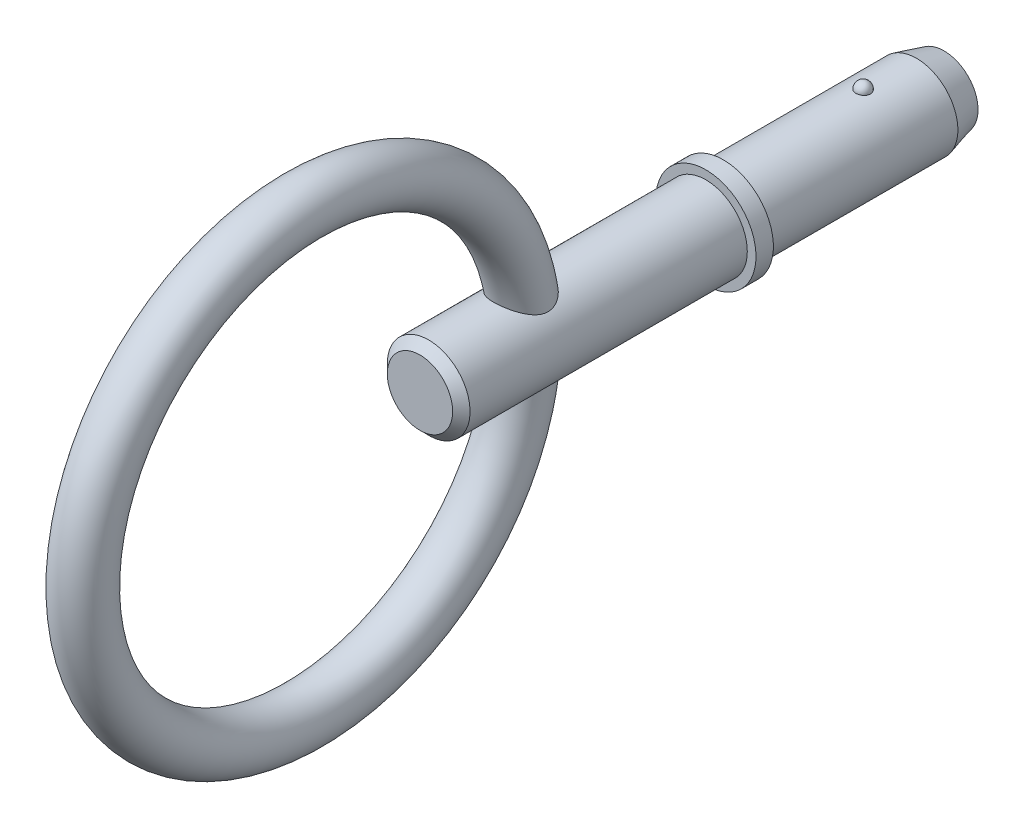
ISO-10303-21;
HEADER;
FILE_DESCRIPTION(('STEP AP214'),'2;1');
FILE_NAME('part.step','',(''),(''),'','','');
FILE_SCHEMA(('AUTOMOTIVE_DESIGN { 1 0 10303 214 1 1 1 1 }'));
ENDSEC;
DATA;
#1=APPLICATION_CONTEXT('core data for automotive mechanical design processes');
#2=APPLICATION_PROTOCOL_DEFINITION('international standard','automotive_design',2000,#1);
#3=PRODUCT_CONTEXT('',#1,'mechanical');
#4=PRODUCT('Part','Part','',(#3));
#5=PRODUCT_RELATED_PRODUCT_CATEGORY('part','',(#4));
#6=PRODUCT_DEFINITION_FORMATION('','',#4);
#7=PRODUCT_DEFINITION_CONTEXT('part definition',#1,'design');
#8=PRODUCT_DEFINITION('design','',#6,#7);
#9=PRODUCT_DEFINITION_SHAPE('','',#8);
#10=(LENGTH_UNIT() NAMED_UNIT(*) SI_UNIT(.MILLI.,.METRE.));
#11=(NAMED_UNIT(*) PLANE_ANGLE_UNIT() SI_UNIT($,.RADIAN.));
#12=(NAMED_UNIT(*) SI_UNIT($,.STERADIAN.) SOLID_ANGLE_UNIT());
#13=UNCERTAINTY_MEASURE_WITH_UNIT(LENGTH_MEASURE(1.E-05),#10,'distance_accuracy_value','');
#14=(GEOMETRIC_REPRESENTATION_CONTEXT(3) GLOBAL_UNCERTAINTY_ASSIGNED_CONTEXT((#13)) GLOBAL_UNIT_ASSIGNED_CONTEXT((#10,
#11,#12)) REPRESENTATION_CONTEXT('',''));
#15=CARTESIAN_POINT('',(0.,0.,0.));
#16=DIRECTION('',(0.,0.,1.));
#17=DIRECTION('',(1.,0.,0.));
#18=AXIS2_PLACEMENT_3D('',#15,#16,#17);
#19=CARTESIAN_POINT('',(0.,0.,7.62));
#20=DIRECTION('',(0.,0.,-1.));
#21=DIRECTION('',(-1.,0.,0.));
#22=AXIS2_PLACEMENT_3D('',#19,#20,#21);
#23=CYLINDRICAL_SURFACE('',#22,2.38);
#24=CARTESIAN_POINT('',(0.418361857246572,2.34294117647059,-0.419999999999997));
#25=CARTESIAN_POINT('',(0.418361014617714,2.34294160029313,-0.396453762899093));
#26=CARTESIAN_POINT('',(0.416399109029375,2.34329426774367,-0.372895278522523));
#27=CARTESIAN_POINT('',(0.408599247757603,2.34466666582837,-0.32643458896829));
#28=CARTESIAN_POINT('',(0.402757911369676,2.34568697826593,-0.303532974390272));
#29=CARTESIAN_POINT('',(0.387358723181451,2.3482789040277,-0.259059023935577));
#30=CARTESIAN_POINT('',(0.377802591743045,2.34985026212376,-0.237486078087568));
#31=CARTESIAN_POINT('',(0.355233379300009,2.35336760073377,-0.196270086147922));
#32=CARTESIAN_POINT('',(0.34222083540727,2.3553135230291,-0.176626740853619));
#33=CARTESIAN_POINT('',(0.313060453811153,2.35936636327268,-0.139777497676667));
#34=CARTESIAN_POINT('',(0.296906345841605,2.36147359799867,-0.122576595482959));
#35=CARTESIAN_POINT('',(0.261921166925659,2.3656092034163,-0.0911421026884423));
#36=CARTESIAN_POINT('',(0.243090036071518,2.36763757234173,-0.0769085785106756));
#37=CARTESIAN_POINT('',(0.203297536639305,2.37138533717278,-0.0518262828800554));
#38=CARTESIAN_POINT('',(0.182338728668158,2.37310509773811,-0.0409735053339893));
#39=CARTESIAN_POINT('',(0.138864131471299,2.37604521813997,-0.0229395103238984));
#40=CARTESIAN_POINT('',(0.116348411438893,2.37726560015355,-0.0157581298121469));
#41=CARTESIAN_POINT('',(0.0705754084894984,2.37906276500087,-0.00531205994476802));
#42=CARTESIAN_POINT('',(0.0473247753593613,2.37964420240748,-0.00201903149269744));
#43=CARTESIAN_POINT('',(0.000593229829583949,2.38011460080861,0.000651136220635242));
#44=CARTESIAN_POINT('',(-0.0228876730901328,2.38000359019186,2.84360175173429E-05));
#45=CARTESIAN_POINT('',(-0.0692686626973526,2.37910422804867,-0.00509943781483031));
#46=CARTESIAN_POINT('',(-0.0921713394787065,2.37831983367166,-0.00958192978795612));
#47=CARTESIAN_POINT('',(-0.136890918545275,2.37616546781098,-0.022272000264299));
#48=CARTESIAN_POINT('',(-0.158707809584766,2.37479549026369,-0.0304796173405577));
#49=CARTESIAN_POINT('',(-0.200704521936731,2.37161607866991,-0.0504168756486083));
#50=CARTESIAN_POINT('',(-0.220879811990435,2.36980547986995,-0.0621558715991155));
#51=CARTESIAN_POINT('',(-0.258974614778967,2.36594575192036,-0.0888218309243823));
#52=CARTESIAN_POINT('',(-0.276894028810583,2.36389661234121,-0.103748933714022));
#53=CARTESIAN_POINT('',(-0.310124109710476,2.35976825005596,-0.136509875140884));
#54=CARTESIAN_POINT('',(-0.325413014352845,2.35768891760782,-0.154365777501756));
#55=CARTESIAN_POINT('',(-0.352793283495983,2.35374782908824,-0.192402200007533));
#56=CARTESIAN_POINT('',(-0.364884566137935,2.35188607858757,-0.212582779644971));
#57=CARTESIAN_POINT('',(-0.385587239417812,2.34858114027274,-0.254794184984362));
#58=CARTESIAN_POINT('',(-0.394183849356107,2.34713973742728,-0.276832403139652));
#59=CARTESIAN_POINT('',(-0.407590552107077,2.3448489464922,-0.322061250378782));
#60=CARTESIAN_POINT('',(-0.412400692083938,2.34399955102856,-0.34525186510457));
#61=CARTESIAN_POINT('',(-0.418098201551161,2.34299005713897,-0.392078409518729));
#62=CARTESIAN_POINT('',(-0.41899328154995,2.34282860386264,-0.415713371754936));
#63=CARTESIAN_POINT('',(-0.416857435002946,2.34320955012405,-0.462799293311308));
#64=CARTESIAN_POINT('',(-0.413826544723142,2.34375194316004,-0.486250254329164));
#65=CARTESIAN_POINT('',(-0.403929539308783,2.34547773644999,-0.532261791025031));
#66=CARTESIAN_POINT('',(-0.397069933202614,2.34666004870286,-0.554823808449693));
#67=CARTESIAN_POINT('',(-0.379705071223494,2.34953208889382,-0.59846383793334));
#68=CARTESIAN_POINT('',(-0.369199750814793,2.35122182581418,-0.61954182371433));
#69=CARTESIAN_POINT('',(-0.344797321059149,2.35492396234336,-0.659671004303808));
#70=CARTESIAN_POINT('',(-0.33089223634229,2.35693711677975,-0.678717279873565));
#71=CARTESIAN_POINT('',(-0.300080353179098,2.36105754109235,-0.714192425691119));
#72=CARTESIAN_POINT('',(-0.283173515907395,2.36316481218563,-0.730621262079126));
#73=CARTESIAN_POINT('',(-0.246801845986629,2.36723962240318,-0.760416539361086));
#74=CARTESIAN_POINT('',(-0.227334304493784,2.36920701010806,-0.773779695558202));
#75=CARTESIAN_POINT('',(-0.186398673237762,2.37277833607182,-0.797042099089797));
#76=CARTESIAN_POINT('',(-0.164930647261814,2.37438228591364,-0.806941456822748));
#77=CARTESIAN_POINT('',(-0.120727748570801,2.37703848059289,-0.82294821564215));
#78=CARTESIAN_POINT('',(-0.0980005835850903,2.37809374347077,-0.829076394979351));
#79=CARTESIAN_POINT('',(-0.0518218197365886,2.37954782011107,-0.837451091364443));
#80=CARTESIAN_POINT('',(-0.0283702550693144,2.37994666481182,-0.839697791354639));
#81=CARTESIAN_POINT('',(0.0184023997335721,2.38004290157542,-0.840243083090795));
#82=CARTESIAN_POINT('',(0.0417231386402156,2.37974556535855,-0.838571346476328));
#83=CARTESIAN_POINT('',(0.0877471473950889,2.37849333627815,-0.831389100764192));
#84=CARTESIAN_POINT('',(0.110450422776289,2.37753844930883,-0.825878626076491));
#85=CARTESIAN_POINT('',(0.154584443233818,2.37507730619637,-0.811179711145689));
#86=CARTESIAN_POINT('',(0.17601599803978,2.37357140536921,-0.801993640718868));
#87=CARTESIAN_POINT('',(0.217028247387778,2.37017355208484,-0.780200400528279));
#88=CARTESIAN_POINT('',(0.236608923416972,2.36828159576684,-0.767593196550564));
#89=CARTESIAN_POINT('',(0.27351405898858,2.36430486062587,-0.739207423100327));
#90=CARTESIAN_POINT('',(0.290821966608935,2.36221883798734,-0.723407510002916));
#91=CARTESIAN_POINT('',(0.322554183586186,2.3580957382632,-0.68912612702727));
#92=CARTESIAN_POINT('',(0.336977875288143,2.35605867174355,-0.670644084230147));
#93=CARTESIAN_POINT('',(0.362636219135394,2.35224677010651,-0.63138169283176));
#94=CARTESIAN_POINT('',(0.373848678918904,2.35047379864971,-0.610586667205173));
#95=CARTESIAN_POINT('',(0.392641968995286,2.34740786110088,-0.567397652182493));
#96=CARTESIAN_POINT('',(0.400225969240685,2.34611447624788,-0.545005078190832));
#97=CARTESIAN_POINT('',(0.410033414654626,2.34441668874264,-0.505456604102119));
#98=CARTESIAN_POINT('',(0.413152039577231,2.34386644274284,-0.488523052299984));
#99=CARTESIAN_POINT('',(0.417316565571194,2.34312853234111,-0.454395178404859));
#100=CARTESIAN_POINT('',(0.418362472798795,2.34294086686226,-0.437200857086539));
#101=CARTESIAN_POINT('',(0.418361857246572,2.34294117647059,-0.419999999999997));
#102=B_SPLINE_CURVE_WITH_KNOTS('',3,(#24,#25,#26,#27,#28,#29,#30,#31,#32,#33,#34,#35,#36,#37,
#38,#39,#40,#41,#42,#43,#44,#45,#46,#47,#48,#49,#50,#51,#52,#53,#54,#55,#56,#57,#58,#59,#60,#61,
#62,#63,#64,#65,#66,#67,#68,#69,#70,#71,#72,#73,#74,#75,#76,#77,#78,#79,#80,#81,#82,#83,#84,#85,
#86,#87,#88,#89,#90,#91,#92,#93,#94,#95,#96,#97,#98,#99,#100,#101),.UNSPECIFIED.,.T.,.F.,(4,2,2,
2,2,2,2,2,2,2,2,2,2,2,2,2,2,2,2,2,2,2,2,2,2,2,2,2,2,2,2,2,2,2,2,2,2,2,4),(0.,0.0705763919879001,
0.141214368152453,0.211819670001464,0.282414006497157,0.353150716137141,0.423889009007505,
0.494543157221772,0.565194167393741,0.635327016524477,0.705456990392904,0.77517764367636,
0.844899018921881,0.914806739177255,0.98471751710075,1.05518143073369,1.1256471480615,
1.19640787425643,1.26716771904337,1.33778814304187,1.40840791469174,1.47890799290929,
1.54940931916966,1.62007764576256,1.69074688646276,1.76149149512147,1.83223384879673,
1.90258285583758,1.97292854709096,2.04274328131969,2.11255738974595,2.18232655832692,
2.25209642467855,2.32234913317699,2.39261687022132,2.4633591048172,2.5340394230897,
2.58559662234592,2.63715366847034),.UNSPECIFIED.);
#103=CARTESIAN_POINT('',(0.418361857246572,2.34294117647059,-0.419999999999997));
#104=VERTEX_POINT('',#103);
#105=EDGE_CURVE('E103',#104,#104,#102,.T.);
#106=ORIENTED_EDGE('',*,*,#105,.T.);
#107=EDGE_LOOP('',(#106));
#108=FACE_BOUND('',#107,.T.);
#109=CARTESIAN_POINT('',(0.,0.,-3.49399999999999));
#110=DIRECTION('',(0.,0.,-1.));
#111=DIRECTION('',(-1.,0.,0.));
#112=AXIS2_PLACEMENT_3D('',#109,#110,#111);
#113=CIRCLE('',#112,2.38);
#114=CARTESIAN_POINT('',(-2.38,0.,-3.49399999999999));
#115=VERTEX_POINT('',#114);
#116=EDGE_CURVE('E111',#115,#115,#113,.F.);
#117=ORIENTED_EDGE('',*,*,#116,.T.);
#118=EDGE_LOOP('',(#117));
#119=FACE_BOUND('',#118,.T.);
#120=CARTESIAN_POINT('',(0.,0.,7.62));
#121=DIRECTION('',(0.,0.,1.));
#122=DIRECTION('',(1.,0.,0.));
#123=AXIS2_PLACEMENT_3D('',#120,#121,#122);
#124=CIRCLE('',#123,2.38);
#125=CARTESIAN_POINT('',(2.38,0.,7.62));
#126=VERTEX_POINT('',#125);
#127=EDGE_CURVE('E109',#126,#126,#124,.T.);
#128=ORIENTED_EDGE('',*,*,#127,.F.);
#129=EDGE_LOOP('',(#128));
#130=FACE_BOUND('',#129,.T.);
#131=ADVANCED_FACE('F39',(#108,#119,#130),#23,.T.);
#132=CARTESIAN_POINT('',(0.,0.,-5.08));
#133=DIRECTION('',(0.,0.,-1.));
#134=DIRECTION('',(-1.,0.,0.));
#135=AXIS2_PLACEMENT_3D('',#132,#133,#134);
#136=PLANE('',#135);
#137=CARTESIAN_POINT('',(0.,0.,-5.08));
#138=DIRECTION('',(0.,0.,-1.));
#139=DIRECTION('',(-1.,0.,0.));
#140=AXIS2_PLACEMENT_3D('',#137,#138,#139);
#141=CIRCLE('',#140,1.95503258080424);
#142=CARTESIAN_POINT('',(-1.95503258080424,0.,-5.08));
#143=VERTEX_POINT('',#142);
#144=EDGE_CURVE('E142',#143,#143,#141,.T.);
#145=ORIENTED_EDGE('',*,*,#144,.T.);
#146=EDGE_LOOP('',(#145));
#147=FACE_BOUND('',#146,.T.);
#148=ADVANCED_FACE('F89',(#147),#136,.T.);
#149=CARTESIAN_POINT('',(0.,0.,-5.08));
#150=DIRECTION('',(0.,0.,1.));
#151=DIRECTION('',(1.,0.,0.));
#152=AXIS2_PLACEMENT_3D('',#149,#150,#151);
#153=CONICAL_SURFACE('',#152,1.95503258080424,0.261799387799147);
#154=ORIENTED_EDGE('',*,*,#116,.F.);
#155=EDGE_LOOP('',(#154));
#156=FACE_BOUND('',#155,.T.);
#157=ORIENTED_EDGE('',*,*,#144,.F.);
#158=EDGE_LOOP('',(#157));
#159=FACE_BOUND('',#158,.T.);
#160=ADVANCED_FACE('F95',(#156,#159),#153,.T.);
#161=CARTESIAN_POINT('',(0.,2.38,-0.419999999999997));
#162=DIRECTION('',(0.,1.,0.));
#163=DIRECTION('',(0.,0.,1.));
#164=AXIS2_PLACEMENT_3D('',#161,#162,#163);
#165=SPHERICAL_SURFACE('',#164,0.419999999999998);
#166=ORIENTED_EDGE('',*,*,#105,.F.);
#167=EDGE_LOOP('',(#166));
#168=FACE_BOUND('',#167,.T.);
#169=ADVANCED_FACE('F114',(#168),#165,.T.);
#170=CARTESIAN_POINT('',(0.,0.,7.62));
#171=DIRECTION('',(0.,0.,-1.));
#172=DIRECTION('',(-1.,0.,0.));
#173=AXIS2_PLACEMENT_3D('',#170,#171,#172);
#174=PLANE('',#173);
#175=ORIENTED_EDGE('',*,*,#127,.T.);
#176=EDGE_LOOP('',(#175));
#177=FACE_BOUND('',#176,.T.);
#178=CARTESIAN_POINT('',(0.,0.,7.62));
#179=DIRECTION('',(0.,0.,-1.));
#180=DIRECTION('',(-1.,0.,0.));
#181=AXIS2_PLACEMENT_3D('',#178,#179,#180);
#182=CIRCLE('',#181,2.88);
#183=CARTESIAN_POINT('',(-2.88,0.,7.62));
#184=VERTEX_POINT('',#183);
#185=EDGE_CURVE('E110',#184,#184,#182,.T.);
#186=ORIENTED_EDGE('',*,*,#185,.T.);
#187=EDGE_LOOP('',(#186));
#188=FACE_BOUND('',#187,.T.);
#189=ADVANCED_FACE('F118',(#177,#188),#174,.T.);
#190=CARTESIAN_POINT('',(0.,0.,33.7287874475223));
#191=DIRECTION('',(0.,0.,-1.));
#192=DIRECTION('',(-1.,0.,0.));
#193=AXIS2_PLACEMENT_3D('',#190,#191,#192);
#194=CYLINDRICAL_SURFACE('',#193,2.88);
#195=CARTESIAN_POINT('',(0.,0.,8.62));
#196=DIRECTION('',(0.,0.,-1.));
#197=DIRECTION('',(-1.,0.,0.));
#198=AXIS2_PLACEMENT_3D('',#195,#196,#197);
#199=CIRCLE('',#198,2.88);
#200=CARTESIAN_POINT('',(-2.88,0.,8.62));
#201=VERTEX_POINT('',#200);
#202=EDGE_CURVE('E135',#201,#201,#199,.T.);
#203=ORIENTED_EDGE('',*,*,#202,.T.);
#204=EDGE_LOOP('',(#203));
#205=FACE_BOUND('',#204,.T.);
#206=ORIENTED_EDGE('',*,*,#185,.F.);
#207=EDGE_LOOP('',(#206));
#208=FACE_BOUND('',#207,.T.);
#209=ADVANCED_FACE('F122',(#205,#208),#194,.T.);
#210=CARTESIAN_POINT('',(0.,2.88,8.62));
#211=DIRECTION('',(0.,0.,1.));
#212=DIRECTION('',(1.,0.,0.));
#213=AXIS2_PLACEMENT_3D('',#210,#211,#212);
#214=PLANE('',#213);
#215=CARTESIAN_POINT('',(0.,0.,8.62));
#216=DIRECTION('',(0.,0.,1.));
#217=DIRECTION('',(1.,0.,0.));
#218=AXIS2_PLACEMENT_3D('',#215,#216,#217);
#219=CIRCLE('',#218,2.38);
#220=CARTESIAN_POINT('',(2.38,0.,8.62));
#221=VERTEX_POINT('',#220);
#222=EDGE_CURVE('E113',#221,#221,#219,.T.);
#223=ORIENTED_EDGE('',*,*,#222,.F.);
#224=EDGE_LOOP('',(#223));
#225=FACE_BOUND('',#224,.T.);
#226=ORIENTED_EDGE('',*,*,#202,.F.);
#227=EDGE_LOOP('',(#226));
#228=FACE_BOUND('',#227,.T.);
#229=ADVANCED_FACE('F86',(#225,#228),#214,.T.);
#230=CARTESIAN_POINT('',(0.,0.,25.07));
#231=DIRECTION('',(0.,0.,-1.));
#232=DIRECTION('',(-1.,0.,0.));
#233=AXIS2_PLACEMENT_3D('',#230,#231,#232);
#234=CYLINDRICAL_SURFACE('',#233,2.38);
#235=CARTESIAN_POINT('',(-0.903407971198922,-2.20187511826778,18.048101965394));
#236=CARTESIAN_POINT('',(-0.839710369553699,-2.22800560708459,18.0036275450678));
#237=CARTESIAN_POINT('',(-0.771955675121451,-2.25255828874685,17.9639200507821));
#238=CARTESIAN_POINT('',(-0.629623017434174,-2.29641711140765,17.8949006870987));
#239=CARTESIAN_POINT('',(-0.55503412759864,-2.31571464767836,17.8656058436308));
#240=CARTESIAN_POINT('',(-0.40067374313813,-2.34735542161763,17.8182943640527));
#241=CARTESIAN_POINT('',(-0.320887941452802,-2.35967847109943,17.8003104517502));
#242=CARTESIAN_POINT('',(-0.158738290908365,-2.37609587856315,17.7764617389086));
#243=CARTESIAN_POINT('',(-0.0763765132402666,-2.38019668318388,17.7705874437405));
#244=CARTESIAN_POINT('',(0.0836658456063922,-2.3797998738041,17.7711603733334));
#245=CARTESIAN_POINT('',(0.161351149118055,-2.37576936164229,17.7769382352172));
#246=CARTESIAN_POINT('',(0.314409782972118,-2.36039486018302,17.7992676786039));
#247=CARTESIAN_POINT('',(0.389782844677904,-2.34905002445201,17.8158205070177));
#248=CARTESIAN_POINT('',(0.535937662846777,-2.32006569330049,17.8590515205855));
#249=CARTESIAN_POINT('',(0.606735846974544,-2.30245039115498,17.8856908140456));
#250=CARTESIAN_POINT('',(0.742521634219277,-2.26231731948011,17.9483720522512));
#251=CARTESIAN_POINT('',(0.8075080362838,-2.23979853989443,17.9844159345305));
#252=CARTESIAN_POINT('',(0.935326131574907,-2.18966592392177,18.0683563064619));
#253=CARTESIAN_POINT('',(0.997591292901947,-2.16179128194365,18.1169595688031));
#254=CARTESIAN_POINT('',(1.11292144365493,-2.10474548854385,18.223560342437));
#255=CARTESIAN_POINT('',(1.16597568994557,-2.07557287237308,18.2815686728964));
#256=CARTESIAN_POINT('',(1.26477130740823,-2.01699124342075,18.4102977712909));
#257=CARTESIAN_POINT('',(1.30983402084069,-1.98768494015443,18.4815920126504));
#258=CARTESIAN_POINT('',(1.38660631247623,-1.93491744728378,18.6329637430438));
#259=CARTESIAN_POINT('',(1.41834090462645,-1.91144534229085,18.7130244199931));
#260=CARTESIAN_POINT('',(1.46422131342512,-1.87648847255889,18.8706940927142));
#261=CARTESIAN_POINT('',(1.47990731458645,-1.86397592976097,18.9476190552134));
#262=CARTESIAN_POINT('',(1.49871691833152,-1.84889326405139,19.1038974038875));
#263=CARTESIAN_POINT('',(1.50185388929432,-1.84631256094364,19.1832481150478));
#264=CARTESIAN_POINT('',(1.4964844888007,-1.85065563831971,19.3288470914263));
#265=CARTESIAN_POINT('',(1.48970686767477,-1.85616871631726,19.3952204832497));
#266=CARTESIAN_POINT('',(1.46828795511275,-1.87315650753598,19.5259075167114));
#267=CARTESIAN_POINT('',(1.4536391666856,-1.88463690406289,19.5902191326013));
#268=CARTESIAN_POINT('',(1.40943250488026,-1.91806137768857,19.7430643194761));
#269=CARTESIAN_POINT('',(1.37616344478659,-1.94238425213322,19.8299991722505));
#270=CARTESIAN_POINT('',(1.29708737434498,-1.99605834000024,19.9963485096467));
#271=CARTESIAN_POINT('',(1.25125268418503,-2.02542060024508,20.075745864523));
#272=CARTESIAN_POINT('',(1.14695036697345,-2.08629729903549,20.2276285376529));
#273=CARTESIAN_POINT('',(1.08823347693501,-2.11784433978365,20.2999296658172));
#274=CARTESIAN_POINT('',(0.959228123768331,-2.17930599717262,20.4340708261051));
#275=CARTESIAN_POINT('',(0.888958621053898,-2.20922318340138,20.4959276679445));
#276=CARTESIAN_POINT('',(0.753368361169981,-2.25851185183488,20.5949333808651));
#277=CARTESIAN_POINT('',(0.690173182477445,-2.2787729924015,20.6345392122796));
#278=CARTESIAN_POINT('',(0.55740971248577,-2.31482439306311,20.7039846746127));
#279=CARTESIAN_POINT('',(0.487846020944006,-2.3306178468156,20.7338312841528));
#280=CARTESIAN_POINT('',(0.342953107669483,-2.35631858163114,20.7820255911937));
#281=CARTESIAN_POINT('',(0.267574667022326,-2.36616750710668,20.800259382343));
#282=CARTESIAN_POINT('',(0.114199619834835,-2.37849775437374,20.8230468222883));
#283=CARTESIAN_POINT('',(0.036205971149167,-2.3809871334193,20.8276154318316));
#284=CARTESIAN_POINT('',(-0.107568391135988,-2.37849121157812,20.8230163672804));
#285=CARTESIAN_POINT('',(-0.173440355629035,-2.37456249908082,20.815790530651));
#286=CARTESIAN_POINT('',(-0.302853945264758,-2.36154811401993,20.7916908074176));
#287=CARTESIAN_POINT('',(-0.366395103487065,-2.35246141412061,20.7748149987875));
#288=CARTESIAN_POINT('',(-0.489880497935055,-2.32988758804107,20.7324346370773));
#289=CARTESIAN_POINT('',(-0.549812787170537,-2.31638670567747,20.7069031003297));
#290=CARTESIAN_POINT('',(-0.665021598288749,-2.28597979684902,20.648489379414));
#291=CARTESIAN_POINT('',(-0.720295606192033,-2.26907194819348,20.6156032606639));
#292=CARTESIAN_POINT('',(-0.851132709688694,-2.22413718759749,20.5263110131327));
#293=CARTESIAN_POINT('',(-0.92368025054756,-2.19467168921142,20.4661969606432));
#294=CARTESIAN_POINT('',(-1.05722916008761,-2.13356097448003,20.3350668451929));
#295=CARTESIAN_POINT('',(-1.1182007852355,-2.10191042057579,20.2640235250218));
#296=CARTESIAN_POINT('',(-1.22894457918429,-2.0391654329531,20.1116118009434));
#297=CARTESIAN_POINT('',(-1.27853191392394,-2.00808682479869,20.0301025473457));
#298=CARTESIAN_POINT('',(-1.36422650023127,-1.95088121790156,19.8587530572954));
#299=CARTESIAN_POINT('',(-1.40036235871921,-1.9247437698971,19.7689310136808));
#300=CARTESIAN_POINT('',(-1.44943039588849,-1.88791548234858,19.6077392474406));
#301=CARTESIAN_POINT('',(-1.46600167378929,-1.87495651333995,19.5380059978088));
#302=CARTESIAN_POINT('',(-1.48984634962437,-1.8560704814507,19.3960551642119));
#303=CARTESIAN_POINT('',(-1.49713400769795,-1.85013263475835,19.323841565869));
#304=CARTESIAN_POINT('',(-1.5014924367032,-1.84660099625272,19.1783634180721));
#305=CARTESIAN_POINT('',(-1.49849436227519,-1.84906342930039,19.1050950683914));
#306=CARTESIAN_POINT('',(-1.48179888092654,-1.8624661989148,18.9605680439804));
#307=CARTESIAN_POINT('',(-1.46809860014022,-1.87340881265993,18.889309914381));
#308=CARTESIAN_POINT('',(-1.43218989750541,-1.90096973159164,18.7572815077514));
#309=CARTESIAN_POINT('',(-1.410850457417,-1.91699396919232,18.6961429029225));
#310=CARTESIAN_POINT('',(-1.36038958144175,-1.95312601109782,18.5784385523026));
#311=CARTESIAN_POINT('',(-1.33126141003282,-1.97323734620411,18.5218768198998));
#312=CARTESIAN_POINT('',(-1.2617310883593,-2.01850590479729,18.4070500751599));
#313=CARTESIAN_POINT('',(-1.22036168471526,-2.04397945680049,18.3494985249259));
#314=CARTESIAN_POINT('',(-1.1295425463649,-2.09553139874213,18.2416488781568));
#315=CARTESIAN_POINT('',(-1.08010424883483,-2.12160888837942,18.1913407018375));
#316=CARTESIAN_POINT('',(-0.987769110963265,-2.16578285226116,18.1104848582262));
#317=CARTESIAN_POINT('',(-0.946517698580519,-2.18419033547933,18.0782016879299));
#318=CARTESIAN_POINT('',(-0.903407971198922,-2.20187511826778,18.048101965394));
#319=B_SPLINE_CURVE_WITH_KNOTS('',3,(#235,#236,#237,#238,#239,#240,#241,#242,#243,#244,#245,
#246,#247,#248,#249,#250,#251,#252,#253,#254,#255,#256,#257,#258,#259,#260,#261,#262,#263,#264,
#265,#266,#267,#268,#269,#270,#271,#272,#273,#274,#275,#276,#277,#278,#279,#280,#281,#282,#283,
#284,#285,#286,#287,#288,#289,#290,#291,#292,#293,#294,#295,#296,#297,#298,#299,#300,#301,#302,
#303,#304,#305,#306,#307,#308,#309,#310,#311,#312,#313,#314,#315,#316,#317,#318),.UNSPECIFIED.,
.T.,.F.,(4,2,2,2,2,2,2,2,2,2,2,2,2,2,2,2,2,2,2,2,2,2,2,2,2,2,2,2,2,2,2,2,2,2,2,2,2,2,2,2,2,4),
(0.,0.245727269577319,0.491854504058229,0.738690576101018,0.985333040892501,1.21821047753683,
1.45111486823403,1.68313021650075,1.91519340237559,2.16541572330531,2.41592795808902,
2.68235417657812,2.94827811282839,3.18521517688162,3.42189976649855,3.62191159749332,
3.82211427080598,4.10918949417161,4.39690224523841,4.69076958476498,4.98415935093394,
5.2151557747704,5.44598665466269,5.67904815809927,5.91185441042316,6.11003726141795,
6.3082595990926,6.50710565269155,6.70605834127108,7.00062466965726,7.29593791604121,
7.59575158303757,7.8949239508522,8.11262207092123,8.32998539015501,8.548806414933,
8.76768621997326,8.96702101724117,9.1665287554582,9.3916479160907,9.61645071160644,
9.78275580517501),.UNSPECIFIED.);
#320=CARTESIAN_POINT('',(-0.903407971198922,-2.20187511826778,18.048101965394));
#321=VERTEX_POINT('',#320);
#322=EDGE_CURVE('E10',#321,#321,#319,.T.);
#323=ORIENTED_EDGE('',*,*,#322,.F.);
#324=EDGE_LOOP('',(#323));
#325=FACE_BOUND('',#324,.T.);
#326=CARTESIAN_POINT('',(-0.903407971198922,2.20187511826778,18.048101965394));
#327=CARTESIAN_POINT('',(-0.970214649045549,2.17445928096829,18.0947550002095));
#328=CARTESIAN_POINT('',(-1.03268838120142,2.14525344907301,18.1467440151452));
#329=CARTESIAN_POINT('',(-1.1477077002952,2.0859961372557,18.2606478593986));
#330=CARTESIAN_POINT('',(-1.20022114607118,2.05594226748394,18.3225936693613));
#331=CARTESIAN_POINT('',(-1.2941155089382,1.99817720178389,18.4559266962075));
#332=CARTESIAN_POINT('',(-1.33544720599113,1.9704767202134,18.5273536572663));
#333=CARTESIAN_POINT('',(-1.40506760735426,1.92146090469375,18.6782024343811));
#334=CARTESIAN_POINT('',(-1.43339046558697,1.90012890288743,18.7576026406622));
#335=CARTESIAN_POINT('',(-1.47338334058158,1.86925714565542,18.9134496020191));
#336=CARTESIAN_POINT('',(-1.48649837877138,1.85870842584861,18.9893198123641));
#337=CARTESIAN_POINT('',(-1.50071746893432,1.8472518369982,19.14287045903));
#338=CARTESIAN_POINT('',(-1.50182784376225,1.84633889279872,19.2205499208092));
#339=CARTESIAN_POINT('',(-1.49326645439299,1.85325786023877,19.363985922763));
#340=CARTESIAN_POINT('',(-1.48506604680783,1.85989666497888,19.4299043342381));
#341=CARTESIAN_POINT('',(-1.46099386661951,1.87886395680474,19.5594790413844));
#342=CARTESIAN_POINT('',(-1.44511553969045,1.8911973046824,19.6231333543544));
#343=CARTESIAN_POINT('',(-1.39754250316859,1.92678855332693,19.7761538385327));
#344=CARTESIAN_POINT('',(-1.36192725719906,1.95245999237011,19.8637372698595));
#345=CARTESIAN_POINT('',(-1.27788657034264,2.00847209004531,20.0309907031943));
#346=CARTESIAN_POINT('',(-1.22943137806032,2.03882352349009,20.1106417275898));
#347=CARTESIAN_POINT('',(-1.11958027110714,2.10119412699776,20.2624206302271));
#348=CARTESIAN_POINT('',(-1.05794784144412,2.13323438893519,20.3343690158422));
#349=CARTESIAN_POINT('',(-0.922772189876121,2.19508493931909,20.4670807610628));
#350=CARTESIAN_POINT('',(-0.849252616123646,2.22489948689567,20.5278658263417));
#351=CARTESIAN_POINT('',(-0.710152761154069,2.27246326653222,20.6223110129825));
#352=CARTESIAN_POINT('',(-0.647015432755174,2.29138112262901,20.6589704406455));
#353=CARTESIAN_POINT('',(-0.514878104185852,2.32463484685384,20.7225884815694));
#354=CARTESIAN_POINT('',(-0.445882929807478,2.3389744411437,20.7495549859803));
#355=CARTESIAN_POINT('',(-0.302797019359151,2.36177853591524,20.7921624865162));
#356=CARTESIAN_POINT('',(-0.228666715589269,2.37019011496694,20.8077015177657));
#357=CARTESIAN_POINT('',(-0.0783799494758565,2.37989644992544,20.8256164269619));
#358=CARTESIAN_POINT('',(-0.00222521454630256,2.38119708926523,20.8280031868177));
#359=CARTESIAN_POINT('',(0.138818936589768,2.37685303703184,20.8199981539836));
#360=CARTESIAN_POINT('',(0.203841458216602,2.37212211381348,20.8112876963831));
#361=CARTESIAN_POINT('',(0.331347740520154,2.3576952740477,20.7845309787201));
#362=CARTESIAN_POINT('',(0.39383094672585,2.34799827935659,20.7664826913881));
#363=CARTESIAN_POINT('',(0.516206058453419,2.32419976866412,20.7216833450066));
#364=CARTESIAN_POINT('',(0.576015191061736,2.31000942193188,20.6947562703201));
#365=CARTESIAN_POINT('',(0.690806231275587,2.27831963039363,20.6336110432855));
#366=CARTESIAN_POINT('',(0.745785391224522,2.26081831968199,20.599388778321));
#367=CARTESIAN_POINT('',(0.876071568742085,2.21443701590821,20.5066108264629));
#368=CARTESIAN_POINT('',(0.948236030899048,2.18416686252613,20.444322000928));
#369=CARTESIAN_POINT('',(1.08068664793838,2.121767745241,20.3088044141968));
#370=CARTESIAN_POINT('',(1.14094076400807,2.08963406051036,20.235547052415));
#371=CARTESIAN_POINT('',(1.24978363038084,2.02643655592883,20.078659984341));
#372=CARTESIAN_POINT('',(1.29819307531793,1.99539463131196,19.9948968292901));
#373=CARTESIAN_POINT('',(1.38094965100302,1.93904233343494,19.8189962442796));
#374=CARTESIAN_POINT('',(1.41533296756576,1.91371728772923,19.7268811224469));
#375=CARTESIAN_POINT('',(1.46011713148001,1.879629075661,19.563926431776));
#376=CARTESIAN_POINT('',(1.47459501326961,1.86818653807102,19.4947778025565));
#377=CARTESIAN_POINT('',(1.49436605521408,1.8524142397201,19.354403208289));
#378=CARTESIAN_POINT('',(1.49967306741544,1.84807375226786,19.2831805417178));
#379=CARTESIAN_POINT('',(1.50029887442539,1.84756805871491,19.1402291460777));
#380=CARTESIAN_POINT('',(1.49556248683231,1.8514480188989,19.068499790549));
#381=CARTESIAN_POINT('',(1.4758165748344,1.86722196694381,18.9273512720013));
#382=CARTESIAN_POINT('',(1.46080121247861,1.87912050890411,18.8579334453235));
#383=CARTESIAN_POINT('',(1.42246467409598,1.90827733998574,18.7282199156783));
#384=CARTESIAN_POINT('',(1.39980172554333,1.92509995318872,18.6676260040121));
#385=CARTESIAN_POINT('',(1.34679091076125,1.96255086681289,18.5511857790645));
#386=CARTESIAN_POINT('',(1.31644034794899,1.98318050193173,18.4953411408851));
#387=CARTESIAN_POINT('',(1.24396057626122,2.02954647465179,18.3814514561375));
#388=CARTESIAN_POINT('',(1.20077385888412,2.05559269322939,18.3242068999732));
#389=CARTESIAN_POINT('',(1.1061641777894,2.10801594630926,18.2171320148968));
#390=CARTESIAN_POINT('',(1.05473535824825,2.13439320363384,18.1673070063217));
#391=CARTESIAN_POINT('',(0.9362027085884,2.18924478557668,18.0687347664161));
#392=CARTESIAN_POINT('',(0.867904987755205,2.21744450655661,18.0212583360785));
#393=CARTESIAN_POINT('',(0.722917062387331,2.26885521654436,17.9377494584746));
#394=CARTESIAN_POINT('',(0.646227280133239,2.2920664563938,17.9017164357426));
#395=CARTESIAN_POINT('',(0.487515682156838,2.33094430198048,17.842591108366));
#396=CARTESIAN_POINT('',(0.405587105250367,2.34671524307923,17.8193190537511));
#397=CARTESIAN_POINT('',(0.237955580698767,2.36958127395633,17.7858521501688));
#398=CARTESIAN_POINT('',(0.152255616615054,2.37668309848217,17.7756471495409));
#399=CARTESIAN_POINT('',(-0.0122990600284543,2.38126478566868,17.7690505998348));
#400=CARTESIAN_POINT('',(-0.0910885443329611,2.37954037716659,17.7715167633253));
#401=CARTESIAN_POINT('',(-0.247004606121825,2.36843740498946,17.7875699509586));
#402=CARTESIAN_POINT('',(-0.324130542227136,2.35905594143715,17.8011611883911));
#403=CARTESIAN_POINT('',(-0.473048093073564,2.33371594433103,17.8385984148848));
#404=CARTESIAN_POINT('',(-0.544914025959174,2.31788812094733,17.8622409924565));
#405=CARTESIAN_POINT('',(-0.683201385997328,2.28095222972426,17.9190265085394));
#406=CARTESIAN_POINT('',(-0.749631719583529,2.25985303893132,17.9521534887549));
#407=CARTESIAN_POINT('',(-0.843767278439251,2.22565914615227,18.0080726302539));
#408=CARTESIAN_POINT('',(-0.874007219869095,2.21394047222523,18.0275705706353));
#409=CARTESIAN_POINT('',(-0.903407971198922,2.20187511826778,18.048101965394));
#410=B_SPLINE_CURVE_WITH_KNOTS('',3,(#326,#327,#328,#329,#330,#331,#332,#333,#334,#335,#336,
#337,#338,#339,#340,#341,#342,#343,#344,#345,#346,#347,#348,#349,#350,#351,#352,#353,#354,#355,
#356,#357,#358,#359,#360,#361,#362,#363,#364,#365,#366,#367,#368,#369,#370,#371,#372,#373,#374,
#375,#376,#377,#378,#379,#380,#381,#382,#383,#384,#385,#386,#387,#388,#389,#390,#391,#392,#393,
#394,#395,#396,#397,#398,#399,#400,#401,#402,#403,#404,#405,#406,#407,#408,#409),.UNSPECIFIED.,
.T.,.F.,(4,2,2,2,2,2,2,2,2,2,2,2,2,2,2,2,2,2,2,2,2,2,2,2,2,2,2,2,2,2,2,2,2,2,2,2,2,2,2,2,2,4),
(0.,0.257815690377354,0.516449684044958,0.776204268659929,1.03527292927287,1.26692758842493,
1.49846022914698,1.69794041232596,1.89759118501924,2.18993090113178,2.48295401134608,
2.78175997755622,3.07997865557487,3.30539912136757,3.53063565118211,3.75785831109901,
3.98489294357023,4.1812829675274,4.37771564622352,4.57830350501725,4.77900474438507,
5.07746482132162,5.37671714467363,5.68025255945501,5.98299985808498,6.19688795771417,
6.41045270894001,6.62519390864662,6.84005717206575,7.03981304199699,7.23963907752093,
7.46764796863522,7.69581957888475,7.9580466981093,8.22026062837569,8.47867938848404,
8.73689726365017,8.97226876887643,9.20772945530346,9.43863631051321,9.66915690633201,
9.78261824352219),.UNSPECIFIED.);
#411=CARTESIAN_POINT('',(-0.903407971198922,2.20187511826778,18.048101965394));
#412=VERTEX_POINT('',#411);
#413=EDGE_CURVE('E51',#412,#412,#410,.T.);
#414=ORIENTED_EDGE('',*,*,#413,.F.);
#415=EDGE_LOOP('',(#414));
#416=FACE_BOUND('',#415,.T.);
#417=CARTESIAN_POINT('',(0.,0.,24.57));
#418=DIRECTION('',(0.,0.,-1.));
#419=DIRECTION('',(-1.,0.,0.));
#420=AXIS2_PLACEMENT_3D('',#417,#418,#419);
#421=CIRCLE('',#420,2.38);
#422=CARTESIAN_POINT('',(-2.38,0.,24.57));
#423=VERTEX_POINT('',#422);
#424=EDGE_CURVE('E65',#423,#423,#421,.T.);
#425=ORIENTED_EDGE('',*,*,#424,.T.);
#426=EDGE_LOOP('',(#425));
#427=FACE_BOUND('',#426,.T.);
#428=ORIENTED_EDGE('',*,*,#222,.T.);
#429=EDGE_LOOP('',(#428));
#430=FACE_BOUND('',#429,.T.);
#431=ADVANCED_FACE('F70',(#325,#416,#427,#430),#234,.T.);
#432=CARTESIAN_POINT('',(0.,0.,25.07));
#433=DIRECTION('',(0.,0.,-1.));
#434=DIRECTION('',(-1.,0.,0.));
#435=AXIS2_PLACEMENT_3D('',#432,#433,#434);
#436=PLANE('',#435);
#437=CARTESIAN_POINT('',(0.,0.,25.07));
#438=DIRECTION('',(0.,0.,-1.));
#439=DIRECTION('',(-1.,0.,0.));
#440=AXIS2_PLACEMENT_3D('',#437,#438,#439);
#441=CIRCLE('',#440,1.87999999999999);
#442=CARTESIAN_POINT('',(-1.87999999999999,0.,25.07));
#443=VERTEX_POINT('',#442);
#444=EDGE_CURVE('E58',#443,#443,#441,.F.);
#445=ORIENTED_EDGE('',*,*,#444,.T.);
#446=EDGE_LOOP('',(#445));
#447=FACE_BOUND('',#446,.T.);
#448=ADVANCED_FACE('F77',(#447),#436,.F.);
#449=CARTESIAN_POINT('',(0.,0.,24.57));
#450=DIRECTION('',(0.,0.,-1.));
#451=DIRECTION('',(-1.,0.,0.));
#452=AXIS2_PLACEMENT_3D('',#449,#450,#451);
#453=CONICAL_SURFACE('',#452,2.38,0.785398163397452);
#454=ORIENTED_EDGE('',*,*,#444,.F.);
#455=EDGE_LOOP('',(#454));
#456=FACE_BOUND('',#455,.T.);
#457=ORIENTED_EDGE('',*,*,#424,.F.);
#458=EDGE_LOOP('',(#457));
#459=FACE_BOUND('',#458,.T.);
#460=ADVANCED_FACE('F41',(#456,#459),#453,.T.);
#461=CARTESIAN_POINT('',(0.,0.,31.77));
#462=DIRECTION('',(1.,0.,0.));
#463=DIRECTION('',(0.,0.,-1.));
#464=AXIS2_PLACEMENT_3D('',#461,#462,#463);
#465=TOROIDAL_SURFACE('',#464,12.7,1.5);
#466=ORIENTED_EDGE('',*,*,#322,.T.);
#467=EDGE_LOOP('',(#466));
#468=FACE_BOUND('',#467,.T.);
#469=ORIENTED_EDGE('',*,*,#413,.T.);
#470=EDGE_LOOP('',(#469));
#471=FACE_BOUND('',#470,.T.);
#472=ADVANCED_FACE('F74',(#468,#471),#465,.T.);
#473=CLOSED_SHELL('',(#131,#148,#160,#169,#189,#209,#229,#431,#448,#460,#472));
#474=MANIFOLD_SOLID_BREP('B2',#473);
#475=ADVANCED_BREP_SHAPE_REPRESENTATION('',(#18,#474),#14);
#476=SHAPE_DEFINITION_REPRESENTATION(#9,#475);
ENDSEC;
END-ISO-10303-21;
